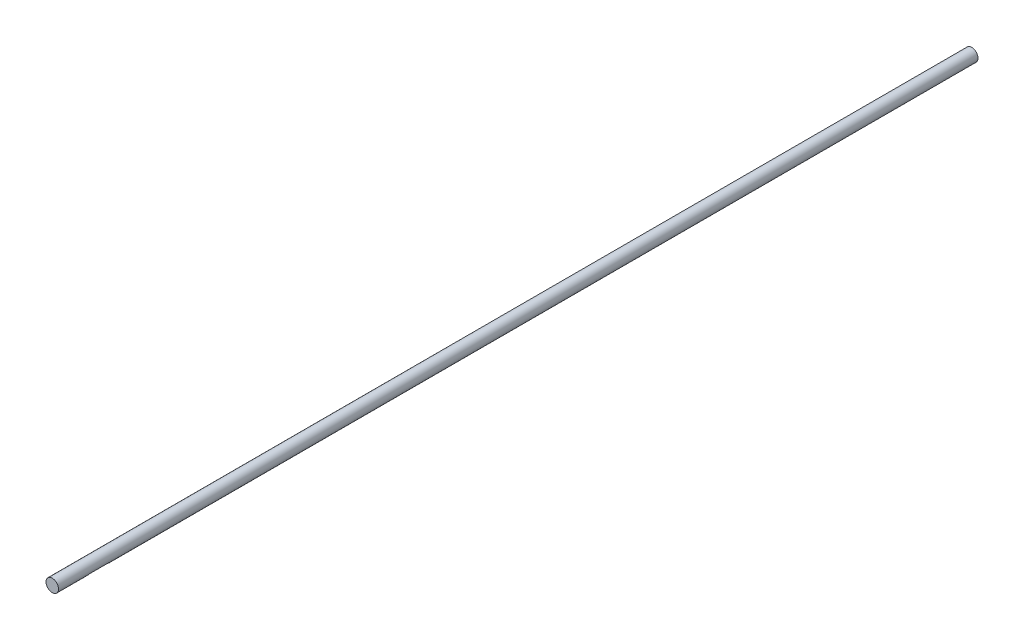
from build123d import *

# Parameters (mm, degrees)
ESQUISSE1_R           = 0.6
EXTRUSION1_DEPTH      = 88
EXTRUSION2_DEPTH      = 89.004090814
EXTRUSION2_DEPTH_BACK = 89.004090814
ESQUISSE2_W           = 2
ESQUISSE2_H           = 0.3


with BuildPart() as part:
    # Esquisse1 → Extrusion1 (new body)
    with BuildSketch(Plane.XY):
        Circle(ESQUISSE1_R)
    extrude(amount=EXTRUSION1_DEPTH)

    # Esquisse2 → Extrusion2 (cut, two sides: drawn at the far end of the back side and taken through both)
    with BuildSketch(Plane(origin=(0, 0, 0), x_dir=(0, 0, -1), z_dir=(1, 0, 0)).offset(-EXTRUSION2_DEPTH_BACK)):
        with Locations((-84, -0.45)):
            Rectangle(ESQUISSE2_W, ESQUISSE2_H)
    extrude(amount=EXTRUSION2_DEPTH + EXTRUSION2_DEPTH_BACK, mode=Mode.SUBTRACT)


solid = part.part
